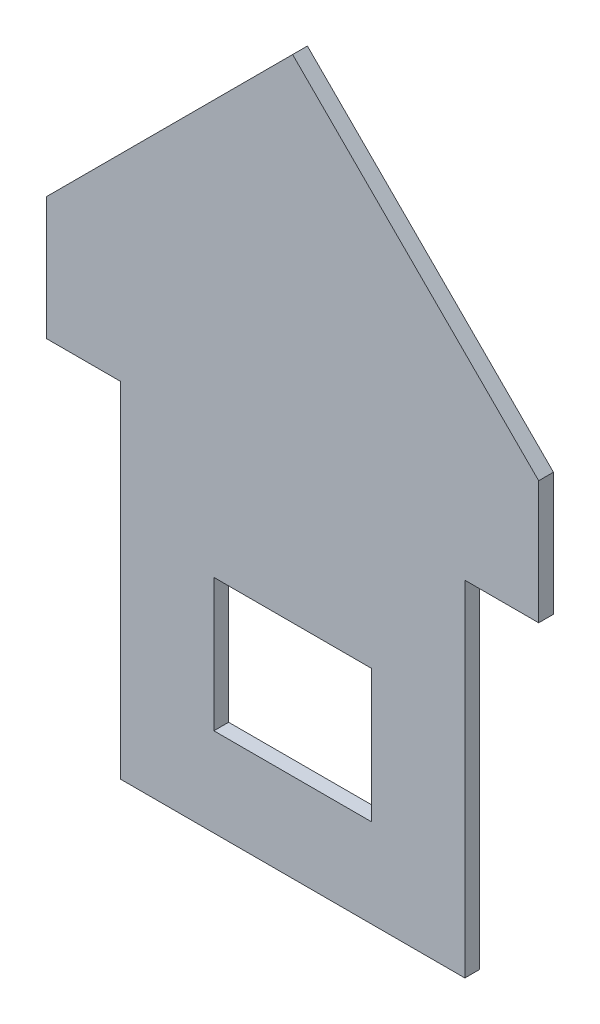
ISO-10303-21;
HEADER;
FILE_DESCRIPTION(('STEP AP214'),'2;1');
FILE_NAME('part.step','',(''),(''),'','','');
FILE_SCHEMA(('AUTOMOTIVE_DESIGN { 1 0 10303 214 1 1 1 1 }'));
ENDSEC;
DATA;
#1=APPLICATION_CONTEXT('core data for automotive mechanical design processes');
#2=APPLICATION_PROTOCOL_DEFINITION('international standard','automotive_design',2000,#1);
#3=PRODUCT_CONTEXT('',#1,'mechanical');
#4=PRODUCT('Part','Part','',(#3));
#5=PRODUCT_RELATED_PRODUCT_CATEGORY('part','',(#4));
#6=PRODUCT_DEFINITION_FORMATION('','',#4);
#7=PRODUCT_DEFINITION_CONTEXT('part definition',#1,'design');
#8=PRODUCT_DEFINITION('design','',#6,#7);
#9=PRODUCT_DEFINITION_SHAPE('','',#8);
#10=(LENGTH_UNIT() NAMED_UNIT(*) SI_UNIT(.MILLI.,.METRE.));
#11=(NAMED_UNIT(*) PLANE_ANGLE_UNIT() SI_UNIT($,.RADIAN.));
#12=(NAMED_UNIT(*) SI_UNIT($,.STERADIAN.) SOLID_ANGLE_UNIT());
#13=UNCERTAINTY_MEASURE_WITH_UNIT(LENGTH_MEASURE(1.E-05),#10,'distance_accuracy_value','');
#14=(GEOMETRIC_REPRESENTATION_CONTEXT(3) GLOBAL_UNCERTAINTY_ASSIGNED_CONTEXT((#13)) GLOBAL_UNIT_ASSIGNED_CONTEXT((#10,
#11,#12)) REPRESENTATION_CONTEXT('',''));
#15=CARTESIAN_POINT('',(0.,0.,0.));
#16=DIRECTION('',(0.,0.,1.));
#17=DIRECTION('',(1.,0.,0.));
#18=AXIS2_PLACEMENT_3D('',#15,#16,#17);
#19=CARTESIAN_POINT('',(0.,24.,0.));
#20=DIRECTION('',(0.,0.,1.));
#21=DIRECTION('',(1.,0.,0.));
#22=AXIS2_PLACEMENT_3D('',#19,#20,#21);
#23=PLANE('',#22);
#24=DIRECTION('',(1.,0.,0.));
#25=VECTOR('',#24,1.);
#26=CARTESIAN_POINT('',(1.6,14.,0.));
#27=LINE('',#26,#25);
#28=CARTESIAN_POINT('',(-1.6,14.,0.));
#29=VERTEX_POINT('',#28);
#30=CARTESIAN_POINT('',(1.6,14.,0.));
#31=VERTEX_POINT('',#30);
#32=EDGE_CURVE('E161',#29,#31,#27,.T.);
#33=ORIENTED_EDGE('',*,*,#32,.F.);
#34=DIRECTION('',(0.,1.,0.));
#35=VECTOR('',#34,1.);
#36=CARTESIAN_POINT('',(-1.6,11.3,0.));
#37=LINE('',#36,#35);
#38=CARTESIAN_POINT('',(-1.6,11.3,0.));
#39=VERTEX_POINT('',#38);
#40=EDGE_CURVE('E175',#39,#29,#37,.T.);
#41=ORIENTED_EDGE('',*,*,#40,.F.);
#42=DIRECTION('',(1.,0.,0.));
#43=VECTOR('',#42,1.);
#44=CARTESIAN_POINT('',(1.6,11.3,0.));
#45=LINE('',#44,#43);
#46=CARTESIAN_POINT('',(1.6,11.3,0.));
#47=VERTEX_POINT('',#46);
#48=EDGE_CURVE('E170',#47,#39,#45,.F.);
#49=ORIENTED_EDGE('',*,*,#48,.F.);
#50=DIRECTION('',(0.,-1.,0.));
#51=VECTOR('',#50,1.);
#52=CARTESIAN_POINT('',(1.6,11.3,0.));
#53=LINE('',#52,#51);
#54=EDGE_CURVE('E164',#31,#47,#53,.T.);
#55=ORIENTED_EDGE('',*,*,#54,.F.);
#56=EDGE_LOOP('',(#33,#41,#49,#55));
#57=FACE_BOUND('',#56,.T.);
#58=DIRECTION('',(0.707106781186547,-0.707106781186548,0.));
#59=VECTOR('',#58,1.);
#60=CARTESIAN_POINT('',(0.,24.,0.));
#61=LINE('',#60,#59);
#62=CARTESIAN_POINT('',(0.,24.,0.));
#63=VERTEX_POINT('',#62);
#64=CARTESIAN_POINT('',(5.,19.,0.));
#65=VERTEX_POINT('',#64);
#66=EDGE_CURVE('E159',#63,#65,#61,.T.);
#67=ORIENTED_EDGE('',*,*,#66,.T.);
#68=DIRECTION('',(0.,-1.,0.));
#69=VECTOR('',#68,1.);
#70=CARTESIAN_POINT('',(5.,16.5,0.));
#71=LINE('',#70,#69);
#72=CARTESIAN_POINT('',(5.,16.5,0.));
#73=VERTEX_POINT('',#72);
#74=EDGE_CURVE('E153',#65,#73,#71,.T.);
#75=ORIENTED_EDGE('',*,*,#74,.T.);
#76=DIRECTION('',(1.,0.,0.));
#77=VECTOR('',#76,1.);
#78=CARTESIAN_POINT('',(5.,16.5,0.));
#79=LINE('',#78,#77);
#80=CARTESIAN_POINT('',(3.5,16.5,0.));
#81=VERTEX_POINT('',#80);
#82=EDGE_CURVE('E148',#73,#81,#79,.F.);
#83=ORIENTED_EDGE('',*,*,#82,.T.);
#84=DIRECTION('',(0.,-1.,0.));
#85=VECTOR('',#84,1.);
#86=CARTESIAN_POINT('',(3.5,16.5,0.));
#87=LINE('',#86,#85);
#88=CARTESIAN_POINT('',(3.5,9.5,0.));
#89=VERTEX_POINT('',#88);
#90=EDGE_CURVE('E143',#81,#89,#87,.T.);
#91=ORIENTED_EDGE('',*,*,#90,.T.);
#92=DIRECTION('',(1.,0.,0.));
#93=VECTOR('',#92,1.);
#94=CARTESIAN_POINT('',(3.5,9.5,0.));
#95=LINE('',#94,#93);
#96=CARTESIAN_POINT('',(-3.5,9.5,0.));
#97=VERTEX_POINT('',#96);
#98=EDGE_CURVE('E138',#89,#97,#95,.F.);
#99=ORIENTED_EDGE('',*,*,#98,.T.);
#100=DIRECTION('',(0.,1.,0.));
#101=VECTOR('',#100,1.);
#102=CARTESIAN_POINT('',(-3.5,16.5,0.));
#103=LINE('',#102,#101);
#104=CARTESIAN_POINT('',(-3.5,16.5,0.));
#105=VERTEX_POINT('',#104);
#106=EDGE_CURVE('E134',#97,#105,#103,.T.);
#107=ORIENTED_EDGE('',*,*,#106,.T.);
#108=DIRECTION('',(1.,0.,0.));
#109=VECTOR('',#108,1.);
#110=CARTESIAN_POINT('',(-3.5,16.5,0.));
#111=LINE('',#110,#109);
#112=CARTESIAN_POINT('',(-5.,16.5,0.));
#113=VERTEX_POINT('',#112);
#114=EDGE_CURVE('E121',#105,#113,#111,.F.);
#115=ORIENTED_EDGE('',*,*,#114,.T.);
#116=DIRECTION('',(0.,1.,0.));
#117=VECTOR('',#116,1.);
#118=CARTESIAN_POINT('',(-5.,16.5,0.));
#119=LINE('',#118,#117);
#120=CARTESIAN_POINT('',(-5.,19.,0.));
#121=VERTEX_POINT('',#120);
#122=EDGE_CURVE('E107',#113,#121,#119,.T.);
#123=ORIENTED_EDGE('',*,*,#122,.T.);
#124=DIRECTION('',(0.707106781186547,0.707106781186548,0.));
#125=VECTOR('',#124,1.);
#126=CARTESIAN_POINT('',(0.,24.,0.));
#127=LINE('',#126,#125);
#128=EDGE_CURVE('E17',#121,#63,#127,.T.);
#129=ORIENTED_EDGE('',*,*,#128,.T.);
#130=EDGE_LOOP('',(#67,#75,#83,#91,#99,#107,#115,#123,#129));
#131=FACE_BOUND('',#130,.T.);
#132=ADVANCED_FACE('F14',(#57,#131),#23,.F.);
#133=CARTESIAN_POINT('',(0.,24.,0.3));
#134=DIRECTION('',(0.707106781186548,-0.707106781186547,0.));
#135=DIRECTION('',(0.707106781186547,0.707106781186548,0.));
#136=AXIS2_PLACEMENT_3D('',#133,#134,#135);
#137=PLANE('',#136);
#138=DIRECTION('',(0.,0.,1.));
#139=VECTOR('',#138,1.);
#140=CARTESIAN_POINT('',(-5.,19.,0.3));
#141=LINE('',#140,#139);
#142=CARTESIAN_POINT('',(-5.,19.,0.3));
#143=VERTEX_POINT('',#142);
#144=EDGE_CURVE('E113',#121,#143,#141,.T.);
#145=ORIENTED_EDGE('',*,*,#144,.T.);
#146=DIRECTION('',(-0.707106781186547,-0.707106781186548,0.));
#147=VECTOR('',#146,1.);
#148=CARTESIAN_POINT('',(0.,24.,0.3));
#149=LINE('',#148,#147);
#150=CARTESIAN_POINT('',(0.,24.,0.3));
#151=VERTEX_POINT('',#150);
#152=EDGE_CURVE('E182',#151,#143,#149,.T.);
#153=ORIENTED_EDGE('',*,*,#152,.F.);
#154=DIRECTION('',(0.,0.,1.));
#155=VECTOR('',#154,1.);
#156=CARTESIAN_POINT('',(0.,24.,0.3));
#157=LINE('',#156,#155);
#158=EDGE_CURVE('E116',#151,#63,#157,.F.);
#159=ORIENTED_EDGE('',*,*,#158,.T.);
#160=ORIENTED_EDGE('',*,*,#128,.F.);
#161=EDGE_LOOP('',(#145,#153,#159,#160));
#162=FACE_BOUND('',#161,.T.);
#163=ADVANCED_FACE('F112',(#162),#137,.F.);
#164=CARTESIAN_POINT('',(-5.,16.5,0.3));
#165=DIRECTION('',(1.,0.,0.));
#166=DIRECTION('',(0.,1.,0.));
#167=AXIS2_PLACEMENT_3D('',#164,#165,#166);
#168=PLANE('',#167);
#169=DIRECTION('',(0.,0.,1.));
#170=VECTOR('',#169,1.);
#171=CARTESIAN_POINT('',(-5.,16.5,0.3));
#172=LINE('',#171,#170);
#173=CARTESIAN_POINT('',(-5.,16.5,0.3));
#174=VERTEX_POINT('',#173);
#175=EDGE_CURVE('E123',#113,#174,#172,.T.);
#176=ORIENTED_EDGE('',*,*,#175,.T.);
#177=DIRECTION('',(0.,1.,0.));
#178=VECTOR('',#177,1.);
#179=CARTESIAN_POINT('',(-5.,24.,0.3));
#180=LINE('',#179,#178);
#181=EDGE_CURVE('E127',#143,#174,#180,.F.);
#182=ORIENTED_EDGE('',*,*,#181,.F.);
#183=ORIENTED_EDGE('',*,*,#144,.F.);
#184=ORIENTED_EDGE('',*,*,#122,.F.);
#185=EDGE_LOOP('',(#176,#182,#183,#184));
#186=FACE_BOUND('',#185,.T.);
#187=ADVANCED_FACE('F125',(#186),#168,.F.);
#188=CARTESIAN_POINT('',(-3.5,16.5,0.3));
#189=DIRECTION('',(0.,1.,0.));
#190=DIRECTION('',(0.,0.,1.));
#191=AXIS2_PLACEMENT_3D('',#188,#189,#190);
#192=PLANE('',#191);
#193=DIRECTION('',(0.,0.,1.));
#194=VECTOR('',#193,1.);
#195=CARTESIAN_POINT('',(-3.5,16.5,0.3));
#196=LINE('',#195,#194);
#197=CARTESIAN_POINT('',(-3.5,16.5,0.3));
#198=VERTEX_POINT('',#197);
#199=EDGE_CURVE('E132',#105,#198,#196,.T.);
#200=ORIENTED_EDGE('',*,*,#199,.T.);
#201=DIRECTION('',(1.,0.,0.));
#202=VECTOR('',#201,1.);
#203=CARTESIAN_POINT('',(0.,16.5,0.3));
#204=LINE('',#203,#202);
#205=EDGE_CURVE('E185',#174,#198,#204,.T.);
#206=ORIENTED_EDGE('',*,*,#205,.F.);
#207=ORIENTED_EDGE('',*,*,#175,.F.);
#208=ORIENTED_EDGE('',*,*,#114,.F.);
#209=EDGE_LOOP('',(#200,#206,#207,#208));
#210=FACE_BOUND('',#209,.T.);
#211=ADVANCED_FACE('F263',(#210),#192,.F.);
#212=CARTESIAN_POINT('',(-3.5,16.5,0.3));
#213=DIRECTION('',(1.,0.,0.));
#214=DIRECTION('',(0.,1.,0.));
#215=AXIS2_PLACEMENT_3D('',#212,#213,#214);
#216=PLANE('',#215);
#217=DIRECTION('',(0.,0.,1.));
#218=VECTOR('',#217,1.);
#219=CARTESIAN_POINT('',(-3.5,9.5,0.3));
#220=LINE('',#219,#218);
#221=CARTESIAN_POINT('',(-3.5,9.5,0.3));
#222=VERTEX_POINT('',#221);
#223=EDGE_CURVE('E136',#97,#222,#220,.T.);
#224=ORIENTED_EDGE('',*,*,#223,.T.);
#225=DIRECTION('',(0.,1.,0.));
#226=VECTOR('',#225,1.);
#227=CARTESIAN_POINT('',(-3.5,24.,0.3));
#228=LINE('',#227,#226);
#229=EDGE_CURVE('E188',#198,#222,#228,.F.);
#230=ORIENTED_EDGE('',*,*,#229,.F.);
#231=ORIENTED_EDGE('',*,*,#199,.F.);
#232=ORIENTED_EDGE('',*,*,#106,.F.);
#233=EDGE_LOOP('',(#224,#230,#231,#232));
#234=FACE_BOUND('',#233,.T.);
#235=ADVANCED_FACE('F259',(#234),#216,.F.);
#236=CARTESIAN_POINT('',(3.5,9.5,0.3));
#237=DIRECTION('',(0.,1.,0.));
#238=DIRECTION('',(0.,0.,1.));
#239=AXIS2_PLACEMENT_3D('',#236,#237,#238);
#240=PLANE('',#239);
#241=DIRECTION('',(0.,0.,1.));
#242=VECTOR('',#241,1.);
#243=CARTESIAN_POINT('',(3.5,9.5,0.3));
#244=LINE('',#243,#242);
#245=CARTESIAN_POINT('',(3.5,9.5,0.3));
#246=VERTEX_POINT('',#245);
#247=EDGE_CURVE('E141',#89,#246,#244,.T.);
#248=ORIENTED_EDGE('',*,*,#247,.T.);
#249=DIRECTION('',(1.,0.,0.));
#250=VECTOR('',#249,1.);
#251=CARTESIAN_POINT('',(0.,9.5,0.3));
#252=LINE('',#251,#250);
#253=EDGE_CURVE('E191',#222,#246,#252,.T.);
#254=ORIENTED_EDGE('',*,*,#253,.F.);
#255=ORIENTED_EDGE('',*,*,#223,.F.);
#256=ORIENTED_EDGE('',*,*,#98,.F.);
#257=EDGE_LOOP('',(#248,#254,#255,#256));
#258=FACE_BOUND('',#257,.T.);
#259=ADVANCED_FACE('F255',(#258),#240,.F.);
#260=CARTESIAN_POINT('',(3.5,16.5,0.3));
#261=DIRECTION('',(-1.,0.,0.));
#262=DIRECTION('',(0.,-1.,0.));
#263=AXIS2_PLACEMENT_3D('',#260,#261,#262);
#264=PLANE('',#263);
#265=DIRECTION('',(0.,0.,1.));
#266=VECTOR('',#265,1.);
#267=CARTESIAN_POINT('',(3.5,16.5,0.3));
#268=LINE('',#267,#266);
#269=CARTESIAN_POINT('',(3.5,16.5,0.3));
#270=VERTEX_POINT('',#269);
#271=EDGE_CURVE('E146',#81,#270,#268,.T.);
#272=ORIENTED_EDGE('',*,*,#271,.T.);
#273=DIRECTION('',(0.,1.,0.));
#274=VECTOR('',#273,1.);
#275=CARTESIAN_POINT('',(3.5,24.,0.3));
#276=LINE('',#275,#274);
#277=EDGE_CURVE('E194',#246,#270,#276,.T.);
#278=ORIENTED_EDGE('',*,*,#277,.F.);
#279=ORIENTED_EDGE('',*,*,#247,.F.);
#280=ORIENTED_EDGE('',*,*,#90,.F.);
#281=EDGE_LOOP('',(#272,#278,#279,#280));
#282=FACE_BOUND('',#281,.T.);
#283=ADVANCED_FACE('F251',(#282),#264,.F.);
#284=CARTESIAN_POINT('',(5.,16.5,0.3));
#285=DIRECTION('',(0.,1.,0.));
#286=DIRECTION('',(0.,0.,1.));
#287=AXIS2_PLACEMENT_3D('',#284,#285,#286);
#288=PLANE('',#287);
#289=DIRECTION('',(0.,0.,1.));
#290=VECTOR('',#289,1.);
#291=CARTESIAN_POINT('',(5.,16.5,0.3));
#292=LINE('',#291,#290);
#293=CARTESIAN_POINT('',(5.,16.5,0.3));
#294=VERTEX_POINT('',#293);
#295=EDGE_CURVE('E151',#73,#294,#292,.T.);
#296=ORIENTED_EDGE('',*,*,#295,.T.);
#297=DIRECTION('',(1.,0.,0.));
#298=VECTOR('',#297,1.);
#299=CARTESIAN_POINT('',(0.,16.5,0.3));
#300=LINE('',#299,#298);
#301=EDGE_CURVE('E197',#270,#294,#300,.T.);
#302=ORIENTED_EDGE('',*,*,#301,.F.);
#303=ORIENTED_EDGE('',*,*,#271,.F.);
#304=ORIENTED_EDGE('',*,*,#82,.F.);
#305=EDGE_LOOP('',(#296,#302,#303,#304));
#306=FACE_BOUND('',#305,.T.);
#307=ADVANCED_FACE('F247',(#306),#288,.F.);
#308=CARTESIAN_POINT('',(5.,16.5,0.3));
#309=DIRECTION('',(-1.,0.,0.));
#310=DIRECTION('',(0.,-1.,0.));
#311=AXIS2_PLACEMENT_3D('',#308,#309,#310);
#312=PLANE('',#311);
#313=DIRECTION('',(0.,0.,1.));
#314=VECTOR('',#313,1.);
#315=CARTESIAN_POINT('',(4.99999999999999,19.,0.3));
#316=LINE('',#315,#314);
#317=CARTESIAN_POINT('',(5.,19.,0.3));
#318=VERTEX_POINT('',#317);
#319=EDGE_CURVE('E156',#65,#318,#316,.T.);
#320=ORIENTED_EDGE('',*,*,#319,.T.);
#321=DIRECTION('',(0.,1.,0.));
#322=VECTOR('',#321,1.);
#323=CARTESIAN_POINT('',(5.,24.,0.3));
#324=LINE('',#323,#322);
#325=EDGE_CURVE('E200',#294,#318,#324,.T.);
#326=ORIENTED_EDGE('',*,*,#325,.F.);
#327=ORIENTED_EDGE('',*,*,#295,.F.);
#328=ORIENTED_EDGE('',*,*,#74,.F.);
#329=EDGE_LOOP('',(#320,#326,#327,#328));
#330=FACE_BOUND('',#329,.T.);
#331=ADVANCED_FACE('F243',(#330),#312,.F.);
#332=CARTESIAN_POINT('',(0.,24.,0.3));
#333=DIRECTION('',(-0.707106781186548,-0.707106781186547,0.));
#334=DIRECTION('',(0.707106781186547,-0.707106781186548,0.));
#335=AXIS2_PLACEMENT_3D('',#332,#333,#334);
#336=PLANE('',#335);
#337=ORIENTED_EDGE('',*,*,#158,.F.);
#338=DIRECTION('',(-0.707106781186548,0.707106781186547,0.));
#339=VECTOR('',#338,1.);
#340=CARTESIAN_POINT('',(5.,19.,0.3));
#341=LINE('',#340,#339);
#342=EDGE_CURVE('E203',#318,#151,#341,.T.);
#343=ORIENTED_EDGE('',*,*,#342,.F.);
#344=ORIENTED_EDGE('',*,*,#319,.F.);
#345=ORIENTED_EDGE('',*,*,#66,.F.);
#346=EDGE_LOOP('',(#337,#343,#344,#345));
#347=FACE_BOUND('',#346,.T.);
#348=ADVANCED_FACE('F240',(#347),#336,.F.);
#349=CARTESIAN_POINT('',(1.6,14.,0.3));
#350=DIRECTION('',(0.,-1.,0.));
#351=DIRECTION('',(0.,0.,-1.));
#352=AXIS2_PLACEMENT_3D('',#349,#350,#351);
#353=PLANE('',#352);
#354=DIRECTION('',(1.,0.,0.));
#355=VECTOR('',#354,1.);
#356=CARTESIAN_POINT('',(0.,14.,0.3));
#357=LINE('',#356,#355);
#358=CARTESIAN_POINT('',(-1.6,14.,0.3));
#359=VERTEX_POINT('',#358);
#360=CARTESIAN_POINT('',(1.6,14.,0.3));
#361=VERTEX_POINT('',#360);
#362=EDGE_CURVE('E206',#359,#361,#357,.T.);
#363=ORIENTED_EDGE('',*,*,#362,.F.);
#364=DIRECTION('',(0.,0.,1.));
#365=VECTOR('',#364,1.);
#366=CARTESIAN_POINT('',(-1.6,14.,0.3));
#367=LINE('',#366,#365);
#368=EDGE_CURVE('E178',#29,#359,#367,.T.);
#369=ORIENTED_EDGE('',*,*,#368,.F.);
#370=ORIENTED_EDGE('',*,*,#32,.T.);
#371=DIRECTION('',(0.,0.,1.));
#372=VECTOR('',#371,1.);
#373=CARTESIAN_POINT('',(1.6,14.,0.3));
#374=LINE('',#373,#372);
#375=EDGE_CURVE('E167',#361,#31,#374,.F.);
#376=ORIENTED_EDGE('',*,*,#375,.F.);
#377=EDGE_LOOP('',(#363,#369,#370,#376));
#378=FACE_BOUND('',#377,.T.);
#379=ADVANCED_FACE('F223',(#378),#353,.T.);
#380=CARTESIAN_POINT('',(1.6,11.3,0.3));
#381=DIRECTION('',(-1.,0.,0.));
#382=DIRECTION('',(0.,-1.,0.));
#383=AXIS2_PLACEMENT_3D('',#380,#381,#382);
#384=PLANE('',#383);
#385=DIRECTION('',(0.,1.,0.));
#386=VECTOR('',#385,1.);
#387=CARTESIAN_POINT('',(1.6,24.,0.3));
#388=LINE('',#387,#386);
#389=CARTESIAN_POINT('',(1.6,11.3,0.3));
#390=VERTEX_POINT('',#389);
#391=EDGE_CURVE('E209',#361,#390,#388,.F.);
#392=ORIENTED_EDGE('',*,*,#391,.F.);
#393=ORIENTED_EDGE('',*,*,#375,.T.);
#394=ORIENTED_EDGE('',*,*,#54,.T.);
#395=DIRECTION('',(0.,0.,1.));
#396=VECTOR('',#395,1.);
#397=CARTESIAN_POINT('',(1.6,11.3,0.3));
#398=LINE('',#397,#396);
#399=EDGE_CURVE('E172',#390,#47,#398,.F.);
#400=ORIENTED_EDGE('',*,*,#399,.F.);
#401=EDGE_LOOP('',(#392,#393,#394,#400));
#402=FACE_BOUND('',#401,.T.);
#403=ADVANCED_FACE('F219',(#402),#384,.T.);
#404=CARTESIAN_POINT('',(1.6,11.3,0.3));
#405=DIRECTION('',(0.,1.,0.));
#406=DIRECTION('',(0.,0.,1.));
#407=AXIS2_PLACEMENT_3D('',#404,#405,#406);
#408=PLANE('',#407);
#409=DIRECTION('',(1.,0.,0.));
#410=VECTOR('',#409,1.);
#411=CARTESIAN_POINT('',(0.,11.3,0.3));
#412=LINE('',#411,#410);
#413=CARTESIAN_POINT('',(-1.6,11.3,0.3));
#414=VERTEX_POINT('',#413);
#415=EDGE_CURVE('E23',#390,#414,#412,.F.);
#416=ORIENTED_EDGE('',*,*,#415,.F.);
#417=ORIENTED_EDGE('',*,*,#399,.T.);
#418=ORIENTED_EDGE('',*,*,#48,.T.);
#419=DIRECTION('',(0.,0.,1.));
#420=VECTOR('',#419,1.);
#421=CARTESIAN_POINT('',(-1.6,11.3,0.3));
#422=LINE('',#421,#420);
#423=EDGE_CURVE('E32',#414,#39,#422,.F.);
#424=ORIENTED_EDGE('',*,*,#423,.F.);
#425=EDGE_LOOP('',(#416,#417,#418,#424));
#426=FACE_BOUND('',#425,.T.);
#427=ADVANCED_FACE('F217',(#426),#408,.T.);
#428=CARTESIAN_POINT('',(-1.6,11.3,0.3));
#429=DIRECTION('',(1.,0.,0.));
#430=DIRECTION('',(0.,1.,0.));
#431=AXIS2_PLACEMENT_3D('',#428,#429,#430);
#432=PLANE('',#431);
#433=DIRECTION('',(0.,1.,0.));
#434=VECTOR('',#433,1.);
#435=CARTESIAN_POINT('',(-1.6,24.,0.3));
#436=LINE('',#435,#434);
#437=EDGE_CURVE('E9',#414,#359,#436,.T.);
#438=ORIENTED_EDGE('',*,*,#437,.F.);
#439=ORIENTED_EDGE('',*,*,#423,.T.);
#440=ORIENTED_EDGE('',*,*,#40,.T.);
#441=ORIENTED_EDGE('',*,*,#368,.T.);
#442=EDGE_LOOP('',(#438,#439,#440,#441));
#443=FACE_BOUND('',#442,.T.);
#444=ADVANCED_FACE('F225',(#443),#432,.T.);
#445=CARTESIAN_POINT('',(0.,24.,0.3));
#446=DIRECTION('',(0.,0.,1.));
#447=DIRECTION('',(1.,0.,0.));
#448=AXIS2_PLACEMENT_3D('',#445,#446,#447);
#449=PLANE('',#448);
#450=ORIENTED_EDGE('',*,*,#415,.T.);
#451=ORIENTED_EDGE('',*,*,#437,.T.);
#452=ORIENTED_EDGE('',*,*,#362,.T.);
#453=ORIENTED_EDGE('',*,*,#391,.T.);
#454=EDGE_LOOP('',(#450,#451,#452,#453));
#455=FACE_BOUND('',#454,.T.);
#456=ORIENTED_EDGE('',*,*,#325,.T.);
#457=ORIENTED_EDGE('',*,*,#342,.T.);
#458=ORIENTED_EDGE('',*,*,#152,.T.);
#459=ORIENTED_EDGE('',*,*,#181,.T.);
#460=ORIENTED_EDGE('',*,*,#205,.T.);
#461=ORIENTED_EDGE('',*,*,#229,.T.);
#462=ORIENTED_EDGE('',*,*,#253,.T.);
#463=ORIENTED_EDGE('',*,*,#277,.T.);
#464=ORIENTED_EDGE('',*,*,#301,.T.);
#465=EDGE_LOOP('',(#456,#457,#458,#459,#460,#461,#462,#463,#464));
#466=FACE_BOUND('',#465,.T.);
#467=ADVANCED_FACE('F214',(#455,#466),#449,.T.);
#468=CLOSED_SHELL('',(#132,#163,#187,#211,#235,#259,#283,#307,#331,#348,#379,#403,#427,#444,#467));
#469=MANIFOLD_SOLID_BREP('B1',#468);
#470=ADVANCED_BREP_SHAPE_REPRESENTATION('',(#18,#469),#14);
#471=SHAPE_DEFINITION_REPRESENTATION(#9,#470);
ENDSEC;
END-ISO-10303-21;
